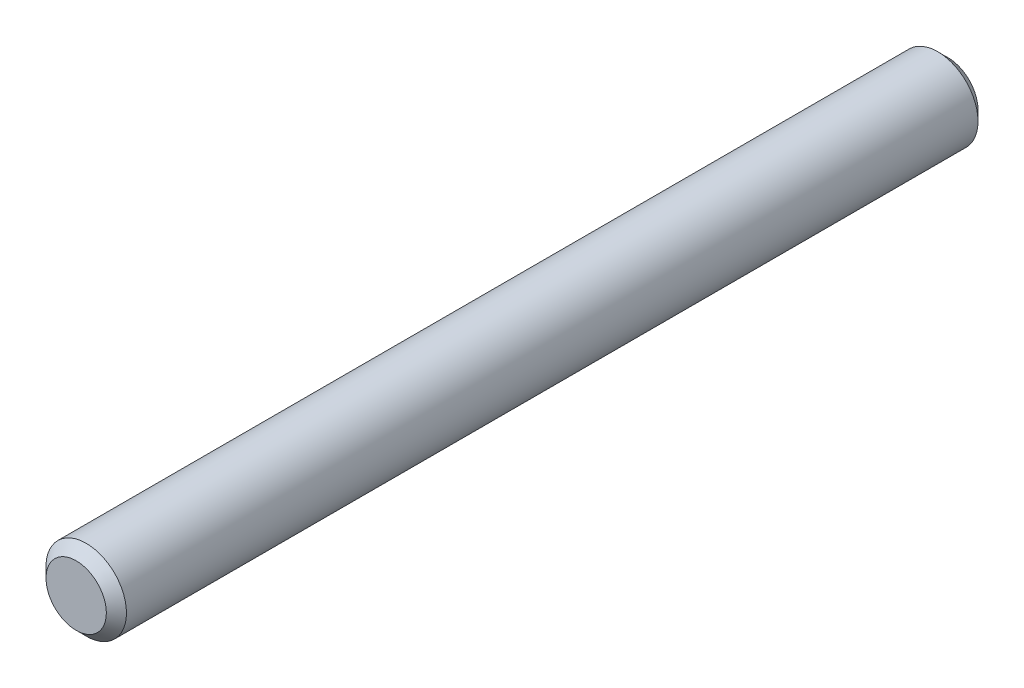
from build123d import *

# Parameters (mm, degrees)
ESQUISSE1_R      = 6
EXTRUSION1_DEPTH = 130
CHANFREIN1_SIZE  = 1.5


with BuildPart() as part:
    # Esquisse1 → Extrusion1 (new body)
    with BuildSketch(Plane.XY):
        Circle(ESQUISSE1_R)
    extrude(amount=-EXTRUSION1_DEPTH)

    # Chanfrein1
    chanfrein1_edges = [part.edges().sort_by_distance(p)[0] for p in [
        (-6, 0, 0),
        (-6, 0, -130),
    ]]
    chamfer(chanfrein1_edges, length=CHANFREIN1_SIZE)


solid = part.part
